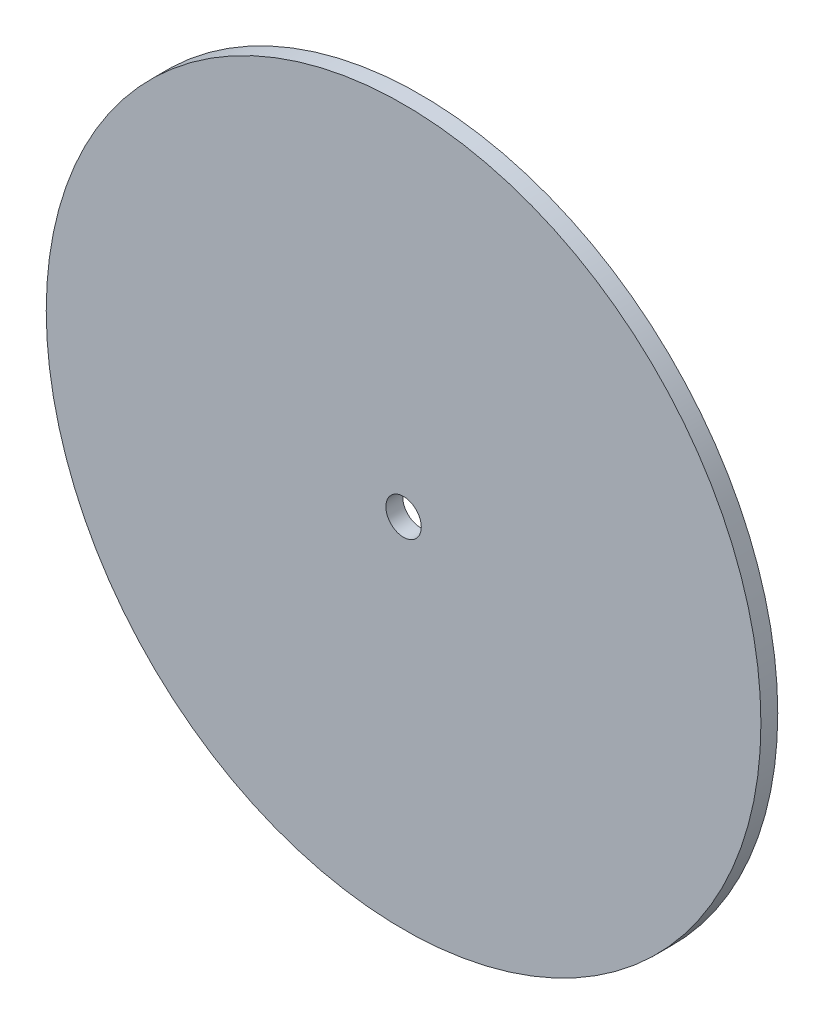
from build123d import *

# Parameters (mm, degrees)
SKIZZE1_R                       = 106
LINEAR_AUSTRAGEN1_DEPTH         = 5
SCHNITT_LINEAR_START            = 5
SKIZZE4_R                       = 5.25
SCHNITT_LINEAR_AUSTRAGEN3_DEPTH = 155.989999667


with BuildPart() as part:
    # Skizze1 → Linear austragen1 (new body)
    with BuildSketch(Plane.XY):
        Circle(SKIZZE1_R)
    extrude(amount=LINEAR_AUSTRAGEN1_DEPTH)

    # Skizze4 → Schnitt-Linear austragen3 (cut, through all)
    with BuildSketch(Plane.XY.offset(SCHNITT_LINEAR_START)):
        Circle(SKIZZE4_R)
    extrude(amount=-SCHNITT_LINEAR_AUSTRAGEN3_DEPTH, mode=Mode.SUBTRACT)


solid = part.part
